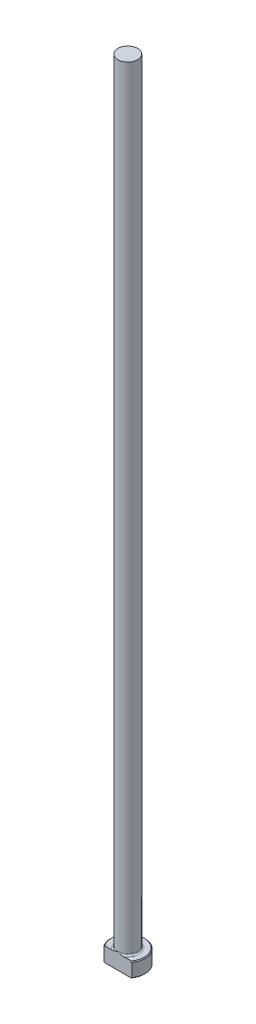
from build123d import *

# Parameters (mm, degrees)
CHAMFER1_SIZE = 0.254
FILLET1_R     = 0.508
KEY_DEPTH     = 255.121236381


with BuildPart() as part:
    # Sketch1 → Revolve1 (revolve)
    with BuildSketch(Plane.XY, mode=Mode.PRIVATE) as revolve1_sk:
        Polygon((0, 0), (-5.5499, 0), (-5.5499, 4.7498), (-3.175, 4.7498), (-3.175, 254), (0, 254), align=None)
    revolve(revolve1_sk.sketch.rotate(Axis((0, 259.958771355, 0), (0, -1, 0)), 270), axis=Axis((0, 259.958771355, 0), (0, -1, 0)))

    # Chamfer1
    chamfer1_edges = [part.edges().sort_by_distance(p)[0] for p in [
        (0, 4.7498, -5.5499),
        (0, 0, -5.5499),
    ]]
    chamfer(chamfer1_edges, length=CHAMFER1_SIZE)

    # Fillet1
    fillet1_edges = [part.edges().sort_by_distance(p)[0] for p in [
        (0, 4.7498, -3.175),
    ]]
    fillet(fillet1_edges, radius=FILLET1_R)

    # Sketch2 → Key (cut, through all)
    with BuildSketch(Plane(origin=(0, 0, 0), x_dir=(1, 0, 0), z_dir=(0, 1, 0))):
        with BuildLine():
            Line((-4.552006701, -3.175), (4.552006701, -3.175))
            ThreePointArc((4.552006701, -3.175), (0, -5.5499), (-4.552006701, -3.175))
        make_face()
    extrude(amount=KEY_DEPTH, mode=Mode.SUBTRACT)


solid = part.part
